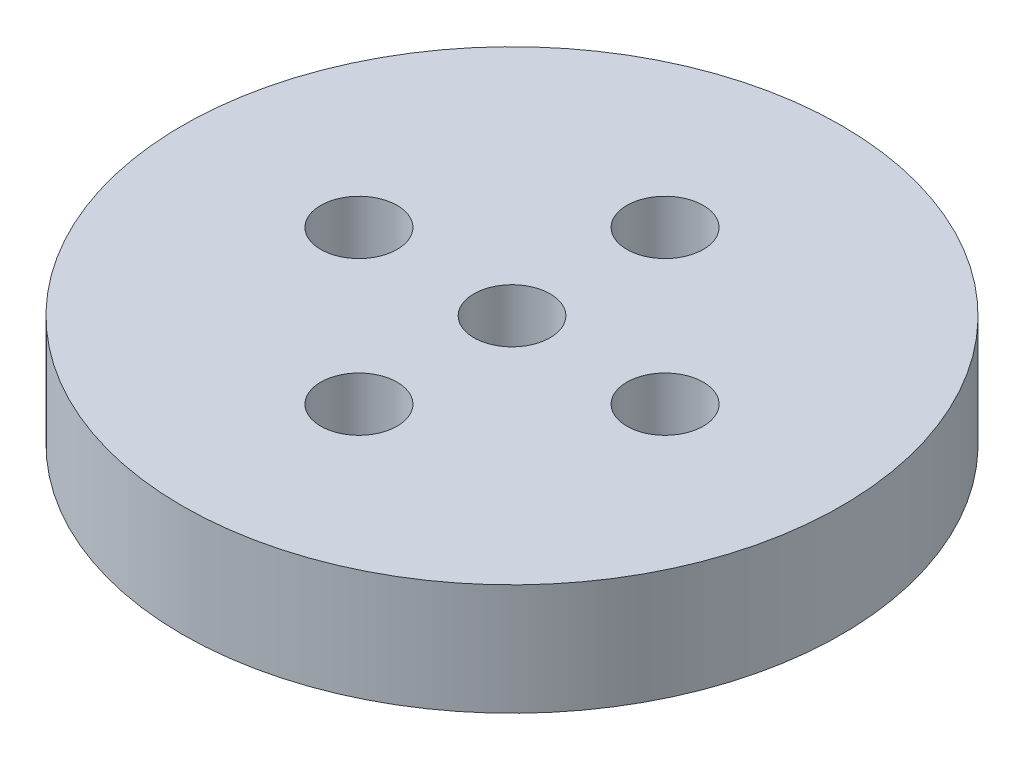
from build123d import *

# Parameters (mm, degrees)
SKETCH1_R           = 16
SKETCH1_R_2         = 1.85
SKETCH1_R_3         = 1.855
BOSS_EXTRUDE1_DEPTH = 5.4


with BuildPart() as part:
    # Sketch1 → Boss-Extrude1 (new body)
    with BuildSketch(Plane(origin=(0, 0, 0), x_dir=(1, 0, 0), z_dir=(0, 1, 0))):
        with Locations(Location((0, 0, 0), (0, 0, 90))):
            Circle(SKETCH1_R)
        with Locations(Location((0, 0, 0), (0, 0, 90))):
            Circle(SKETCH1_R_2, mode=Mode.SUBTRACT)
        with Locations(Location((0, 7.43169227, 0), (0, 0, 90))):
            Circle(SKETCH1_R_3, mode=Mode.SUBTRACT)
        with Locations(Location((7.43169227, 0, 0), (0, 0, 90))):
            Circle(SKETCH1_R_3, mode=Mode.SUBTRACT)
        with Locations(Location((0, -7.43169227, 0), (0, 0, 90))):
            Circle(SKETCH1_R_3, mode=Mode.SUBTRACT)
        with Locations(Location((-7.43169227, 0, 0), (0, 0, 90))):
            Circle(SKETCH1_R_3, mode=Mode.SUBTRACT)
    extrude(amount=BOSS_EXTRUDE1_DEPTH)


solid = part.part
